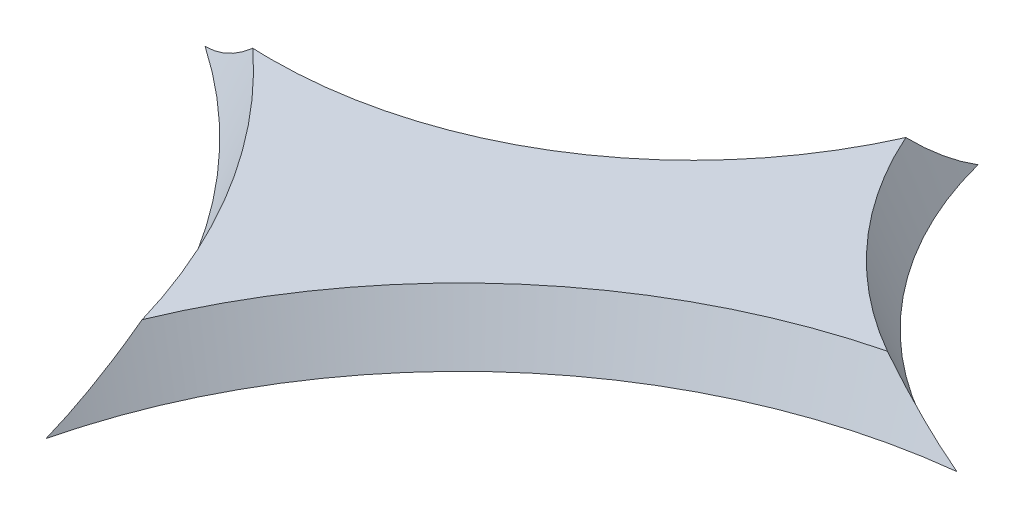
ISO-10303-21;
HEADER;
FILE_DESCRIPTION(('STEP AP214'),'2;1');
FILE_NAME('part.step','',(''),(''),'','','');
FILE_SCHEMA(('AUTOMOTIVE_DESIGN { 1 0 10303 214 1 1 1 1 }'));
ENDSEC;
DATA;
#1=APPLICATION_CONTEXT('core data for automotive mechanical design processes');
#2=APPLICATION_PROTOCOL_DEFINITION('international standard','automotive_design',2000,#1);
#3=PRODUCT_CONTEXT('',#1,'mechanical');
#4=PRODUCT('Part','Part','',(#3));
#5=PRODUCT_RELATED_PRODUCT_CATEGORY('part','',(#4));
#6=PRODUCT_DEFINITION_FORMATION('','',#4);
#7=PRODUCT_DEFINITION_CONTEXT('part definition',#1,'design');
#8=PRODUCT_DEFINITION('design','',#6,#7);
#9=PRODUCT_DEFINITION_SHAPE('','',#8);
#10=(LENGTH_UNIT() NAMED_UNIT(*) SI_UNIT(.MILLI.,.METRE.));
#11=(NAMED_UNIT(*) PLANE_ANGLE_UNIT() SI_UNIT($,.RADIAN.));
#12=(NAMED_UNIT(*) SI_UNIT($,.STERADIAN.) SOLID_ANGLE_UNIT());
#13=UNCERTAINTY_MEASURE_WITH_UNIT(LENGTH_MEASURE(1.E-05),#10,'distance_accuracy_value','');
#14=(GEOMETRIC_REPRESENTATION_CONTEXT(3) GLOBAL_UNCERTAINTY_ASSIGNED_CONTEXT((#13)) GLOBAL_UNIT_ASSIGNED_CONTEXT((#10,
#11,#12)) REPRESENTATION_CONTEXT('',''));
#15=CARTESIAN_POINT('',(0.,0.,0.));
#16=DIRECTION('',(0.,0.,1.));
#17=DIRECTION('',(1.,0.,0.));
#18=AXIS2_PLACEMENT_3D('',#15,#16,#17);
#19=CARTESIAN_POINT('',(33.,12.,-12.8));
#20=DIRECTION('',(0.,1.,0.));
#21=DIRECTION('',(0.,0.,1.));
#22=AXIS2_PLACEMENT_3D('',#19,#20,#21);
#23=CONICAL_SURFACE('',#22,5.99,0.380506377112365);
#24=CARTESIAN_POINT('',(31.0491448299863,12.0000000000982,-7.13658547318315));
#25=CARTESIAN_POINT('',(30.9990484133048,12.0277416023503,-7.14210560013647));
#26=CARTESIAN_POINT('',(30.9495046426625,12.0564623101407,-7.14765356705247));
#27=CARTESIAN_POINT('',(30.8503591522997,12.1163802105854,-7.15892724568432));
#28=CARTESIAN_POINT('',(30.8007829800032,12.1476195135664,-7.16465408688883));
#29=CARTESIAN_POINT('',(30.7015400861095,12.2125717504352,-7.17629061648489));
#30=CARTESIAN_POINT('',(30.6519009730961,12.2463265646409,-7.18220134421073));
#31=CARTESIAN_POINT('',(30.5524970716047,12.3163109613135,-7.19420961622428));
#32=CARTESIAN_POINT('',(30.502761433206,12.3525817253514,-7.20030807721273));
#33=CARTESIAN_POINT('',(30.4031313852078,12.427598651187,-7.21269464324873));
#34=CARTESIAN_POINT('',(30.353267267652,12.4663848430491,-7.21898351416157));
#35=CARTESIAN_POINT('',(30.2533479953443,12.5464342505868,-7.23175267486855));
#36=CARTESIAN_POINT('',(30.2033238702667,12.5877360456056,-7.23823355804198));
#37=CARTESIAN_POINT('',(30.1030533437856,12.6728171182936,-7.25138743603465));
#38=CARTESIAN_POINT('',(30.0528383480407,12.7166332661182,-7.25806083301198));
#39=CARTESIAN_POINT('',(29.9521563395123,12.8067490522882,-7.27159970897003));
#40=CARTESIAN_POINT('',(29.9017208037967,12.8530838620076,-7.27846539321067));
#41=CARTESIAN_POINT('',(29.8518383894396,12.899999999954,-7.28533061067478));
#42=B_SPLINE_CURVE_WITH_KNOTS('',3,(#24,#25,#26,#27,#28,#29,#30,#31,#32,#33,#34,#35,#36,#37,#38,
#39,#40,#41),.UNSPECIFIED.,.F.,.F.,(4,2,2,2,2,2,2,2,4),(0.,0.172570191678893,0.349161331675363,
0.530084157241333,0.7156262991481,0.906053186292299,1.10160915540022,1.30251869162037,
1.50898773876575),.UNSPECIFIED.);
#43=CARTESIAN_POINT('',(31.0491448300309,12.0000000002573,-7.13658547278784));
#44=VERTEX_POINT('',#43);
#45=CARTESIAN_POINT('',(29.8518383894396,12.899999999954,-7.28533061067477));
#46=VERTEX_POINT('',#45);
#47=EDGE_CURVE('E11',#44,#46,#42,.T.);
#48=ORIENTED_EDGE('',*,*,#47,.F.);
#49=CARTESIAN_POINT('',(33.,12.,-12.8));
#50=DIRECTION('',(0.,1.,0.));
#51=DIRECTION('',(0.,0.,1.));
#52=AXIS2_PLACEMENT_3D('',#49,#50,#51);
#53=CIRCLE('',#52,5.99);
#54=CARTESIAN_POINT('',(27.1999999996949,12.,-11.3033036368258));
#55=VERTEX_POINT('',#54);
#56=EDGE_CURVE('E77',#55,#44,#53,.T.);
#57=ORIENTED_EDGE('',*,*,#56,.F.);
#58=CARTESIAN_POINT('',(27.2000000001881,12.0000000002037,-11.303303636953));
#59=CARTESIAN_POINT('',(27.2000003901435,12.028396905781,-11.2578470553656));
#60=CARTESIAN_POINT('',(27.2000036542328,12.0576540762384,-11.2129351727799));
#61=CARTESIAN_POINT('',(27.200012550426,12.1184931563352,-11.1230279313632));
#62=CARTESIAN_POINT('',(27.2000182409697,12.1501153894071,-11.07805982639));
#63=CARTESIAN_POINT('',(27.2000283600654,12.2156817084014,-10.9880059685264));
#64=CARTESIAN_POINT('',(27.200032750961,12.2496652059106,-10.9429489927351));
#65=CARTESIAN_POINT('',(27.2000386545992,12.3199560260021,-10.8526820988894));
#66=CARTESIAN_POINT('',(27.2000400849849,12.3563015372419,-10.8075019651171));
#67=CARTESIAN_POINT('',(27.200039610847,12.4313174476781,-10.716955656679));
#68=CARTESIAN_POINT('',(27.2000376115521,12.4700244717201,-10.6716198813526));
#69=CARTESIAN_POINT('',(27.2000310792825,12.5497654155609,-10.5807305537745));
#70=CARTESIAN_POINT('',(27.2000264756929,12.5908342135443,-10.5352076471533));
#71=CARTESIAN_POINT('',(27.2000165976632,12.6752994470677,-10.4439135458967));
#72=CARTESIAN_POINT('',(27.2000113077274,12.7187288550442,-10.3981729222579));
#73=CARTESIAN_POINT('',(27.2000030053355,12.8079213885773,-10.3064154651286));
#74=CARTESIAN_POINT('',(27.2000000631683,12.8537156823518,-10.2604288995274));
#75=CARTESIAN_POINT('',(27.2,12.8999999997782,-10.2149468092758));
#76=B_SPLINE_CURVE_WITH_KNOTS('',3,(#58,#59,#60,#61,#62,#63,#64,#65,#66,#67,#68,#69,#70,#71,#72,
#73,#74,#75),.UNSPECIFIED.,.F.,.F.,(4,2,2,2,2,2,2,2,4),(0.,0.160773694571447,0.325660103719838,
0.494938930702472,0.668866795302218,0.847678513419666,1.03158850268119,1.22079224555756,
1.41546775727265),.UNSPECIFIED.);
#77=CARTESIAN_POINT('',(27.2,12.8999999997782,-10.2149468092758));
#78=VERTEX_POINT('',#77);
#79=EDGE_CURVE('E132',#55,#78,#76,.T.);
#80=ORIENTED_EDGE('',*,*,#79,.T.);
#81=CARTESIAN_POINT('',(33.,12.9,-12.8));
#82=DIRECTION('',(0.,1.,0.));
#83=DIRECTION('',(0.,0.,1.));
#84=AXIS2_PLACEMENT_3D('',#81,#82,#83);
#85=CIRCLE('',#84,6.35);
#86=EDGE_CURVE('E27',#78,#46,#85,.T.);
#87=ORIENTED_EDGE('',*,*,#86,.T.);
#88=EDGE_LOOP('',(#48,#57,#80,#87));
#89=FACE_BOUND('',#88,.T.);
#90=ADVANCED_FACE('F16',(#89),#23,.F.);
#91=CARTESIAN_POINT('',(32.,12.,1.3));
#92=DIRECTION('',(0.,1.,0.));
#93=DIRECTION('',(0.,0.,1.));
#94=AXIS2_PLACEMENT_3D('',#91,#92,#93);
#95=CONICAL_SURFACE('',#94,8.49,0.380506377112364);
#96=CARTESIAN_POINT('',(23.7484033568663,12.0000000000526,-0.697812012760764));
#97=CARTESIAN_POINT('',(23.7511909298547,12.0271486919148,-0.75547650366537));
#98=CARTESIAN_POINT('',(23.7539734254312,12.0554034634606,-0.812613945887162));
#99=CARTESIAN_POINT('',(23.7595825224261,12.1145241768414,-0.926926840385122));
#100=CARTESIAN_POINT('',(23.7624089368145,12.145430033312,-0.9840816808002));
#101=CARTESIAN_POINT('',(23.7681108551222,12.2098503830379,-1.09846413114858));
#102=CARTESIAN_POINT('',(23.7709861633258,12.2434056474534,-1.15566873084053));
#103=CARTESIAN_POINT('',(23.7767891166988,12.3131245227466,-1.27018867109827));
#104=CARTESIAN_POINT('',(23.7797165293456,12.3493291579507,-1.3274790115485));
#105=CARTESIAN_POINT('',(23.7856256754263,12.4243465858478,-1.44220628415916));
#106=CARTESIAN_POINT('',(23.7886071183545,12.4632001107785,-1.49961655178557));
#107=CARTESIAN_POINT('',(23.7946249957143,12.5435160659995,-1.61461884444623));
#108=CARTESIAN_POINT('',(23.797661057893,12.5850185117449,-1.67218290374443));
#109=CARTESIAN_POINT('',(23.8037876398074,12.6706321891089,-1.78752663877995));
#110=CARTESIAN_POINT('',(23.8068776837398,12.7147823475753,-1.84527738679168));
#111=CARTESIAN_POINT('',(23.8131104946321,12.8056964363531,-1.9610278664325));
#112=CARTESIAN_POINT('',(23.8162526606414,12.8524980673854,-2.01899804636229));
#113=CARTESIAN_POINT('',(23.8193803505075,12.9000000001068,-2.07638299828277));
#114=B_SPLINE_CURVE_WITH_KNOTS('',3,(#96,#97,#98,#99,#100,#101,#102,#103,#104,#105,#106,#107,
#108,#109,#110,#111,#112,#113),.UNSPECIFIED.,.F.,.F.,(4,2,2,2,2,2,2,2,4),(0.,0.191369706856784,
0.386438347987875,0.585547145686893,0.789015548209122,0.997141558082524,1.21020233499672,
1.42845500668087,1.65213762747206),.UNSPECIFIED.);
#115=CARTESIAN_POINT('',(23.7484033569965,12.,-0.697812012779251));
#116=VERTEX_POINT('',#115);
#117=CARTESIAN_POINT('',(23.8193803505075,12.9000000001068,-2.07638299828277));
#118=VERTEX_POINT('',#117);
#119=EDGE_CURVE('E72',#116,#118,#114,.T.);
#120=ORIENTED_EDGE('',*,*,#119,.F.);
#121=CARTESIAN_POINT('',(32.,12.,1.3));
#122=DIRECTION('',(0.,1.,0.));
#123=DIRECTION('',(0.,0.,1.));
#124=AXIS2_PLACEMENT_3D('',#121,#122,#123);
#125=CIRCLE('',#124,8.49);
#126=EDGE_CURVE('E88',#44,#116,#125,.T.);
#127=ORIENTED_EDGE('',*,*,#126,.F.);
#128=ORIENTED_EDGE('',*,*,#47,.T.);
#129=CARTESIAN_POINT('',(32.,12.9,1.3));
#130=DIRECTION('',(0.,1.,0.));
#131=DIRECTION('',(0.,0.,1.));
#132=AXIS2_PLACEMENT_3D('',#129,#130,#131);
#133=CIRCLE('',#132,8.85);
#134=EDGE_CURVE('E68',#46,#118,#133,.T.);
#135=ORIENTED_EDGE('',*,*,#134,.T.);
#136=EDGE_LOOP('',(#120,#127,#128,#135));
#137=FACE_BOUND('',#136,.T.);
#138=ADVANCED_FACE('F70',(#137),#95,.F.);
#139=CARTESIAN_POINT('',(21.056242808,12.9,-2.027551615));
#140=DIRECTION('',(0.,-1.,0.));
#141=DIRECTION('',(0.,0.,-1.));
#142=AXIS2_PLACEMENT_3D('',#139,#140,#141);
#143=PLANE('',#142);
#144=CARTESIAN_POINT('',(14.6,12.9,0.6));
#145=DIRECTION('',(0.,1.,0.));
#146=DIRECTION('',(0.,0.,1.));
#147=AXIS2_PLACEMENT_3D('',#144,#145,#146);
#148=CIRCLE('',#147,9.6);
#149=CARTESIAN_POINT('',(21.1087016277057,12.9,-6.45668499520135));
#150=VERTEX_POINT('',#149);
#151=EDGE_CURVE('E80',#118,#150,#148,.T.);
#152=ORIENTED_EDGE('',*,*,#151,.F.);
#153=ORIENTED_EDGE('',*,*,#134,.F.);
#154=ORIENTED_EDGE('',*,*,#86,.F.);
#155=CARTESIAN_POINT('',(21.4,12.9,-12.8));
#156=DIRECTION('',(0.,1.,0.));
#157=DIRECTION('',(0.,0.,1.));
#158=AXIS2_PLACEMENT_3D('',#155,#156,#157);
#159=CIRCLE('',#158,6.35);
#160=CARTESIAN_POINT('',(21.4,12.9,-6.45));
#161=VERTEX_POINT('',#160);
#162=EDGE_CURVE('E204',#161,#78,#159,.T.);
#163=ORIENTED_EDGE('',*,*,#162,.F.);
#164=CARTESIAN_POINT('',(21.4,12.9,-12.8));
#165=DIRECTION('',(0.,1.,0.));
#166=DIRECTION('',(0.,0.,1.));
#167=AXIS2_PLACEMENT_3D('',#164,#165,#166);
#168=CIRCLE('',#167,6.35);
#169=EDGE_CURVE('E83',#150,#161,#168,.T.);
#170=ORIENTED_EDGE('',*,*,#169,.F.);
#171=EDGE_LOOP('',(#152,#153,#154,#163,#170));
#172=FACE_BOUND('',#171,.T.);
#173=ADVANCED_FACE('F81',(#172),#143,.F.);
#174=CARTESIAN_POINT('',(19.757784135,12.,-0.634179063));
#175=DIRECTION('',(0.,-1.,0.));
#176=DIRECTION('',(0.,0.,-1.));
#177=AXIS2_PLACEMENT_3D('',#174,#175,#176);
#178=PLANE('',#177);
#179=ORIENTED_EDGE('',*,*,#126,.T.);
#180=CARTESIAN_POINT('',(14.6,12.,0.6));
#181=DIRECTION('',(0.,-1.,0.));
#182=DIRECTION('',(0.,0.,1.));
#183=AXIS2_PLACEMENT_3D('',#180,#181,#182);
#184=CIRCLE('',#183,9.24);
#185=CARTESIAN_POINT('',(19.8251282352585,12.,-7.02073716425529));
#186=VERTEX_POINT('',#185);
#187=EDGE_CURVE('E92',#186,#116,#184,.T.);
#188=ORIENTED_EDGE('',*,*,#187,.F.);
#189=CARTESIAN_POINT('',(21.4,12.,-12.8));
#190=DIRECTION('',(0.,1.,0.));
#191=DIRECTION('',(0.,0.,1.));
#192=AXIS2_PLACEMENT_3D('',#189,#190,#191);
#193=CIRCLE('',#192,5.99);
#194=CARTESIAN_POINT('',(21.4,12.,-6.81));
#195=VERTEX_POINT('',#194);
#196=EDGE_CURVE('E122',#186,#195,#193,.T.);
#197=ORIENTED_EDGE('',*,*,#196,.T.);
#198=CARTESIAN_POINT('',(21.4,12.,-12.8));
#199=DIRECTION('',(0.,1.,0.));
#200=DIRECTION('',(0.,0.,1.));
#201=AXIS2_PLACEMENT_3D('',#198,#199,#200);
#202=CIRCLE('',#201,5.99);
#203=EDGE_CURVE('E160',#195,#55,#202,.T.);
#204=ORIENTED_EDGE('',*,*,#203,.T.);
#205=ORIENTED_EDGE('',*,*,#56,.T.);
#206=EDGE_LOOP('',(#179,#188,#197,#204,#205));
#207=FACE_BOUND('',#206,.T.);
#208=ADVANCED_FACE('F111',(#207),#178,.T.);
#209=CARTESIAN_POINT('',(14.6,12.,0.6));
#210=DIRECTION('',(0.,1.,0.));
#211=DIRECTION('',(0.,0.,1.));
#212=AXIS2_PLACEMENT_3D('',#209,#210,#211);
#213=CONICAL_SURFACE('',#212,9.24,0.380506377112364);
#214=CARTESIAN_POINT('',(19.8251282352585,12.,-7.02073716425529));
#215=CARTESIAN_POINT('',(19.8784496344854,12.0244862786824,-6.99605521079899));
#216=CARTESIAN_POINT('',(19.9312745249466,12.0504297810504,-6.97177557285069));
#217=CARTESIAN_POINT('',(20.0370371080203,12.1055747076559,-6.92348250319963));
#218=CARTESIAN_POINT('',(20.0899521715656,12.1348348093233,-6.89948640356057));
#219=CARTESIAN_POINT('',(20.1959429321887,12.1966081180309,-6.85172445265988));
#220=CARTESIAN_POINT('',(20.2489914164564,12.2291829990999,-6.82797829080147));
#221=CARTESIAN_POINT('',(20.355305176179,12.2975837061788,-6.78068241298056));
#222=CARTESIAN_POINT('',(20.4085394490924,12.3334725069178,-6.75715429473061));
#223=CARTESIAN_POINT('',(20.515277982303,12.4085001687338,-6.71026595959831));
#224=CARTESIAN_POINT('',(20.5687481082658,12.4477018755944,-6.6869288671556));
#225=CARTESIAN_POINT('',(20.6760112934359,12.5293564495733,-6.64039827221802));
#226=CARTESIAN_POINT('',(20.7297678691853,12.5718709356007,-6.61722903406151));
#227=CARTESIAN_POINT('',(20.8376552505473,12.6601507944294,-6.57101388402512));
#228=CARTESIAN_POINT('',(20.8917479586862,12.7059756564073,-6.54799302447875));
#229=CARTESIAN_POINT('',(21.000358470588,12.8008859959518,-6.50205897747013));
#230=CARTESIAN_POINT('',(21.0548372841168,12.8500285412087,-6.47917134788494));
#231=CARTESIAN_POINT('',(21.1087016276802,12.8999999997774,-6.45668499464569));
#232=B_SPLINE_CURVE_WITH_KNOTS('',3,(#214,#215,#216,#217,#218,#219,#220,#221,#222,#223,#224,
#225,#226,#227,#228,#229,#230,#231),.UNSPECIFIED.,.F.,.F.,(4,2,2,2,2,2,2,2,4),(0.,
0.190928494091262,0.386017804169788,0.585837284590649,0.790912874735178,1.00172742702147,
1.21872198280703,1.44229773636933,1.67281845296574),.UNSPECIFIED.);
#233=EDGE_CURVE('E131',#186,#150,#232,.T.);
#234=ORIENTED_EDGE('',*,*,#233,.F.);
#235=ORIENTED_EDGE('',*,*,#187,.T.);
#236=ORIENTED_EDGE('',*,*,#119,.T.);
#237=ORIENTED_EDGE('',*,*,#151,.T.);
#238=EDGE_LOOP('',(#234,#235,#236,#237));
#239=FACE_BOUND('',#238,.T.);
#240=ADVANCED_FACE('F91',(#239),#213,.F.);
#241=CARTESIAN_POINT('',(21.4,12.,-12.8));
#242=DIRECTION('',(0.,1.,0.));
#243=DIRECTION('',(0.,0.,1.));
#244=AXIS2_PLACEMENT_3D('',#241,#242,#243);
#245=CONICAL_SURFACE('',#244,5.99,0.380506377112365);
#246=DIRECTION('',(0.,0.928476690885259,0.371390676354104));
#247=VECTOR('',#246,1.);
#248=CARTESIAN_POINT('',(21.4,12.,-6.81));
#249=LINE('',#248,#247);
#250=EDGE_CURVE('E202',#195,#161,#249,.T.);
#251=ORIENTED_EDGE('',*,*,#250,.F.);
#252=ORIENTED_EDGE('',*,*,#196,.F.);
#253=ORIENTED_EDGE('',*,*,#233,.T.);
#254=ORIENTED_EDGE('',*,*,#169,.T.);
#255=EDGE_LOOP('',(#251,#252,#253,#254));
#256=FACE_BOUND('',#255,.T.);
#257=ADVANCED_FACE('F110',(#256),#245,.F.);
#258=CARTESIAN_POINT('',(21.4,12.,-12.8));
#259=DIRECTION('',(0.,1.,0.));
#260=DIRECTION('',(0.,0.,1.));
#261=AXIS2_PLACEMENT_3D('',#258,#259,#260);
#262=CONICAL_SURFACE('',#261,5.99,0.380506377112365);
#263=ORIENTED_EDGE('',*,*,#203,.F.);
#264=ORIENTED_EDGE('',*,*,#250,.T.);
#265=ORIENTED_EDGE('',*,*,#162,.T.);
#266=ORIENTED_EDGE('',*,*,#79,.F.);
#267=EDGE_LOOP('',(#263,#264,#265,#266));
#268=FACE_BOUND('',#267,.T.);
#269=ADVANCED_FACE('F162',(#268),#262,.F.);
#270=CLOSED_SHELL('',(#90,#138,#173,#208,#240,#257,#269));
#271=MANIFOLD_SOLID_BREP('B1',#270);
#272=ADVANCED_BREP_SHAPE_REPRESENTATION('',(#18,#271),#14);
#273=SHAPE_DEFINITION_REPRESENTATION(#9,#272);
ENDSEC;
END-ISO-10303-21;
